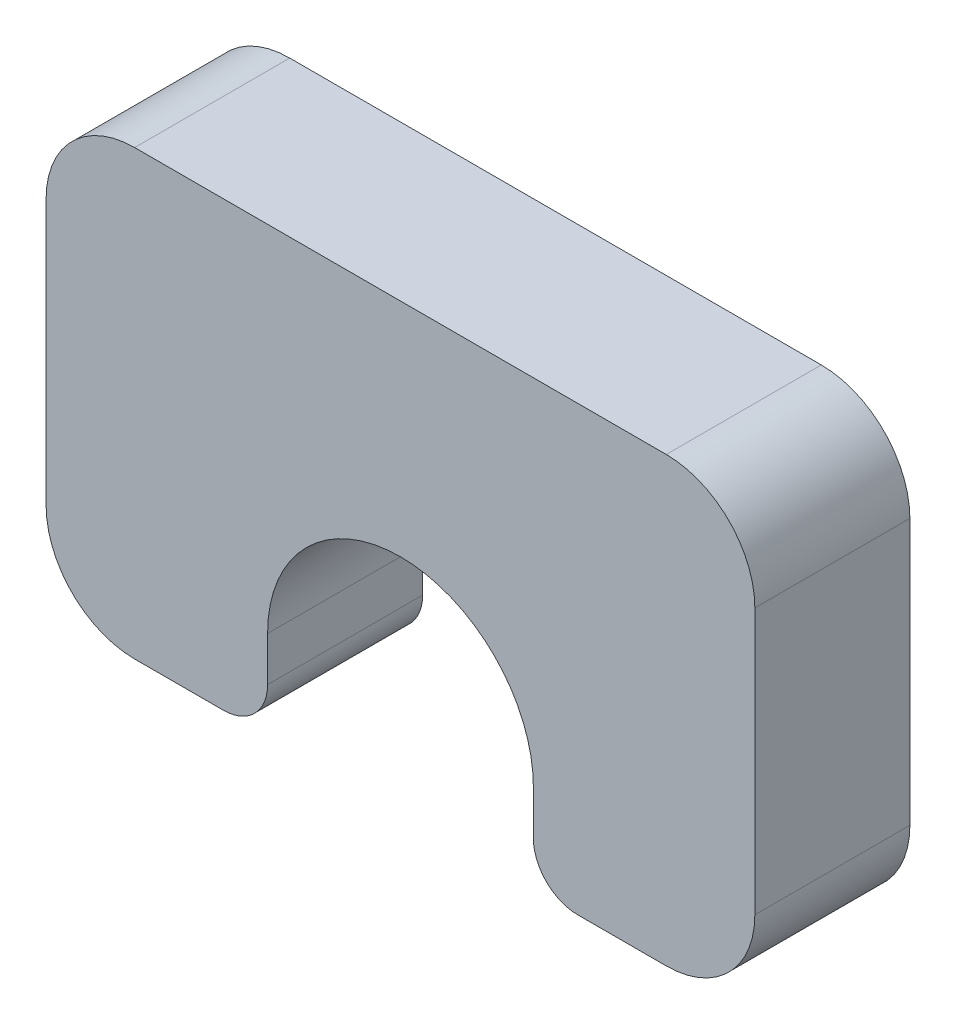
from build123d import *

# Parameters (mm, degrees)
BOSS_EXTRUDE1_DEPTH = 3.5


with BuildPart() as part:
    # Sketch1 → Boss-Extrude1 (new body)
    with BuildSketch(Plane.XY):
        with BuildLine():
            Line((2, 0), (4, 0))
            ThreePointArc((4, 0), (4.707106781, 0.292893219), (5, 1))
            Line((5, 1), (5, 2))
            ThreePointArc((5, 2), (8, 5), (11, 2))
            Line((11, 2), (11, 1))
            ThreePointArc((11, 1), (11.292893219, 0.292893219), (12, 0))
            Line((12, 0), (14, 0))
            ThreePointArc((14, 0), (15.414213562, 0.585786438), (16, 2))
            Line((16, 2), (16, 8))
            ThreePointArc((16, 8), (15.414213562, 9.414213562), (14, 10))
            Line((14, 10), (2, 10))
            ThreePointArc((2, 10), (0.585786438, 9.414213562), (0, 8))
            Line((0, 8), (0, 2))
            ThreePointArc((0, 2), (0.585786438, 0.585786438), (2, 0))
        make_face()
    extrude(amount=BOSS_EXTRUDE1_DEPTH)


solid = part.part
